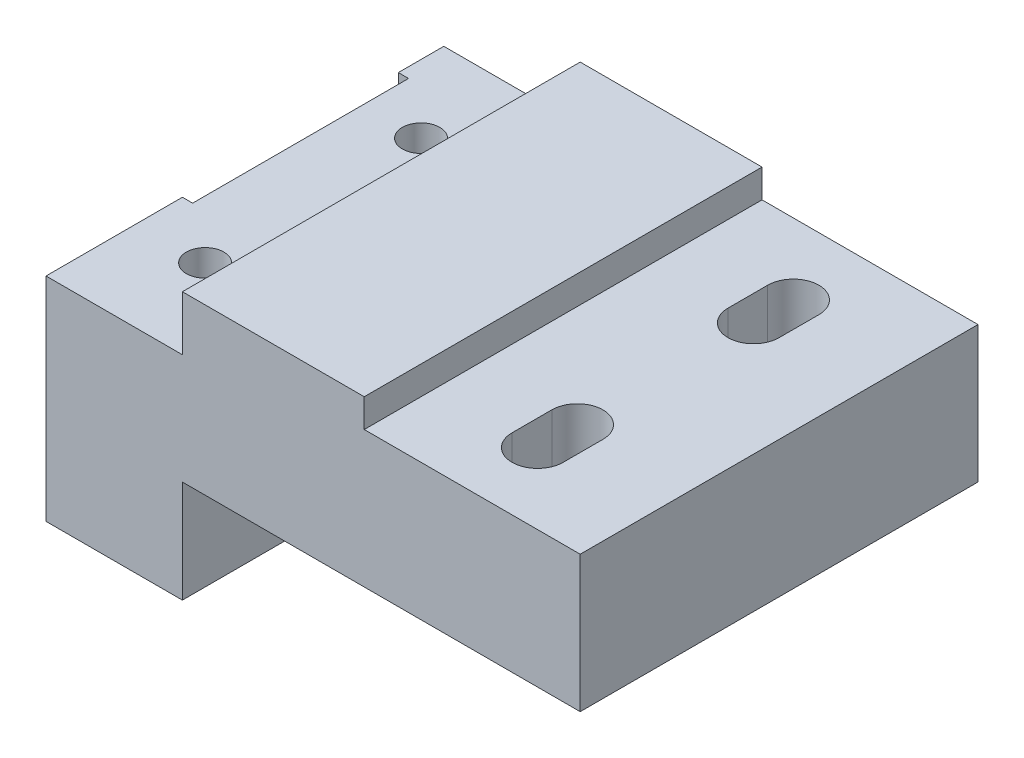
ISO-10303-21;
HEADER;
FILE_DESCRIPTION(('STEP AP214'),'2;1');
FILE_NAME('part.step','',(''),(''),'','','');
FILE_SCHEMA(('AUTOMOTIVE_DESIGN { 1 0 10303 214 1 1 1 1 }'));
ENDSEC;
DATA;
#1=APPLICATION_CONTEXT('core data for automotive mechanical design processes');
#2=APPLICATION_PROTOCOL_DEFINITION('international standard','automotive_design',2000,#1);
#3=PRODUCT_CONTEXT('',#1,'mechanical');
#4=PRODUCT('Part','Part','',(#3));
#5=PRODUCT_RELATED_PRODUCT_CATEGORY('part','',(#4));
#6=PRODUCT_DEFINITION_FORMATION('','',#4);
#7=PRODUCT_DEFINITION_CONTEXT('part definition',#1,'design');
#8=PRODUCT_DEFINITION('design','',#6,#7);
#9=PRODUCT_DEFINITION_SHAPE('','',#8);
#10=(LENGTH_UNIT() NAMED_UNIT(*) SI_UNIT(.MILLI.,.METRE.));
#11=(NAMED_UNIT(*) PLANE_ANGLE_UNIT() SI_UNIT($,.RADIAN.));
#12=(NAMED_UNIT(*) SI_UNIT($,.STERADIAN.) SOLID_ANGLE_UNIT());
#13=UNCERTAINTY_MEASURE_WITH_UNIT(LENGTH_MEASURE(1.E-05),#10,'distance_accuracy_value','');
#14=(GEOMETRIC_REPRESENTATION_CONTEXT(3) GLOBAL_UNCERTAINTY_ASSIGNED_CONTEXT((#13)) GLOBAL_UNIT_ASSIGNED_CONTEXT((#10,
#11,#12)) REPRESENTATION_CONTEXT('',''));
#15=CARTESIAN_POINT('',(0.,0.,0.));
#16=DIRECTION('',(0.,0.,1.));
#17=DIRECTION('',(1.,0.,0.));
#18=AXIS2_PLACEMENT_3D('',#15,#16,#17);
#19=CARTESIAN_POINT('',(-205.999999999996,220.185793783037,35.));
#20=DIRECTION('',(1.,0.,0.));
#21=DIRECTION('',(0.,1.,0.));
#22=AXIS2_PLACEMENT_3D('',#19,#20,#21);
#23=PLANE('',#22);
#24=DIRECTION('',(0.,-1.,0.));
#25=VECTOR('',#24,1.);
#26=CARTESIAN_POINT('',(-206.,220.185793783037,3.99999999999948));
#27=LINE('',#26,#25);
#28=CARTESIAN_POINT('',(-206.,211.185793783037,3.99999999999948));
#29=VERTEX_POINT('',#28);
#30=CARTESIAN_POINT('',(-206.,196.685793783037,3.99999999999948));
#31=VERTEX_POINT('',#30);
#32=EDGE_CURVE('E415',#29,#31,#27,.T.);
#33=ORIENTED_EDGE('',*,*,#32,.F.);
#34=DIRECTION('',(0.,0.,-1.));
#35=VECTOR('',#34,1.);
#36=CARTESIAN_POINT('',(-206.,211.185793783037,10.));
#37=LINE('',#36,#35);
#38=CARTESIAN_POINT('',(-206.,211.185793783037,0.));
#39=VERTEX_POINT('',#38);
#40=EDGE_CURVE('E390',#29,#39,#37,.T.);
#41=ORIENTED_EDGE('',*,*,#40,.T.);
#42=DIRECTION('',(0.,-1.,0.));
#43=VECTOR('',#42,1.);
#44=CARTESIAN_POINT('',(-205.999999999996,220.185793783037,0.));
#45=LINE('',#44,#43);
#46=CARTESIAN_POINT('',(-206.,196.685793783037,0.));
#47=VERTEX_POINT('',#46);
#48=EDGE_CURVE('E448',#39,#47,#45,.T.);
#49=ORIENTED_EDGE('',*,*,#48,.T.);
#50=DIRECTION('',(0.,0.,-1.));
#51=VECTOR('',#50,1.);
#52=CARTESIAN_POINT('',(-206.,196.685793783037,35.));
#53=LINE('',#52,#51);
#54=EDGE_CURVE('E464',#31,#47,#53,.T.);
#55=ORIENTED_EDGE('',*,*,#54,.F.);
#56=EDGE_LOOP('',(#33,#41,#49,#55));
#57=FACE_BOUND('',#56,.T.);
#58=ADVANCED_FACE('F16',(#57),#23,.F.);
#59=CARTESIAN_POINT('',(-205.099999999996,220.185793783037,3.99999999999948));
#60=DIRECTION('',(0.,0.,-1.));
#61=DIRECTION('',(-1.,0.,0.));
#62=AXIS2_PLACEMENT_3D('',#59,#60,#61);
#63=PLANE('',#62);
#64=DIRECTION('',(0.,-1.,0.));
#65=VECTOR('',#64,1.);
#66=CARTESIAN_POINT('',(-205.099999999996,220.185793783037,3.99999999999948));
#67=LINE('',#66,#65);
#68=CARTESIAN_POINT('',(-205.1,211.185793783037,3.99999999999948));
#69=VERTEX_POINT('',#68);
#70=CARTESIAN_POINT('',(-205.099999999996,196.685793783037,3.99999999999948));
#71=VERTEX_POINT('',#70);
#72=EDGE_CURVE('E412',#69,#71,#67,.T.);
#73=ORIENTED_EDGE('',*,*,#72,.F.);
#74=DIRECTION('',(-1.,0.,0.));
#75=VECTOR('',#74,1.);
#76=CARTESIAN_POINT('',(-205.099999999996,211.185793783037,3.99999999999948));
#77=LINE('',#76,#75);
#78=EDGE_CURVE('E480',#69,#29,#77,.T.);
#79=ORIENTED_EDGE('',*,*,#78,.T.);
#80=ORIENTED_EDGE('',*,*,#32,.T.);
#81=DIRECTION('',(1.,0.,0.));
#82=VECTOR('',#81,1.);
#83=CARTESIAN_POINT('',(-205.099999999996,196.685793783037,3.99999999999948));
#84=LINE('',#83,#82);
#85=EDGE_CURVE('E405',#31,#71,#84,.T.);
#86=ORIENTED_EDGE('',*,*,#85,.T.);
#87=EDGE_LOOP('',(#73,#79,#80,#86));
#88=FACE_BOUND('',#87,.T.);
#89=ADVANCED_FACE('F544',(#88),#63,.F.);
#90=CARTESIAN_POINT('',(-205.999999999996,215.385793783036,3.99999999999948));
#91=VERTEX_POINT('',#90);
#92=CARTESIAN_POINT('',(-206.,213.185793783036,3.99999999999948));
#93=VERTEX_POINT('',#92);
#94=EDGE_CURVE('E413',#91,#93,#27,.T.);
#95=ORIENTED_EDGE('',*,*,#94,.F.);
#96=DIRECTION('',(0.,0.,1.));
#97=VECTOR('',#96,1.);
#98=CARTESIAN_POINT('',(-205.999999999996,215.385793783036,0.));
#99=LINE('',#98,#97);
#100=CARTESIAN_POINT('',(-205.999999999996,215.385793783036,0.));
#101=VERTEX_POINT('',#100);
#102=EDGE_CURVE('E374',#101,#91,#99,.T.);
#103=ORIENTED_EDGE('',*,*,#102,.F.);
#104=CARTESIAN_POINT('',(-206.,213.185793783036,0.));
#105=VERTEX_POINT('',#104);
#106=EDGE_CURVE('E449',#101,#105,#45,.T.);
#107=ORIENTED_EDGE('',*,*,#106,.T.);
#108=DIRECTION('',(0.,0.,-1.));
#109=VECTOR('',#108,1.);
#110=CARTESIAN_POINT('',(-206.,213.185793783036,10.));
#111=LINE('',#110,#109);
#112=EDGE_CURVE('E389',#93,#105,#111,.T.);
#113=ORIENTED_EDGE('',*,*,#112,.F.);
#114=EDGE_LOOP('',(#95,#103,#107,#113));
#115=FACE_BOUND('',#114,.T.);
#116=ADVANCED_FACE('F547',(#115),#23,.F.);
#117=CARTESIAN_POINT('',(-159.,217.685793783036,35.));
#118=DIRECTION('',(-1.,0.,0.));
#119=DIRECTION('',(0.,0.,1.));
#120=AXIS2_PLACEMENT_3D('',#117,#118,#119);
#121=PLANE('',#120);
#122=DIRECTION('',(0.,1.,0.));
#123=VECTOR('',#122,1.);
#124=CARTESIAN_POINT('',(-159.,217.685793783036,0.));
#125=LINE('',#124,#123);
#126=CARTESIAN_POINT('',(-159.,205.685793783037,0.));
#127=VERTEX_POINT('',#126);
#128=CARTESIAN_POINT('',(-159.,217.685793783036,0.));
#129=VERTEX_POINT('',#128);
#130=EDGE_CURVE('E411',#127,#129,#125,.T.);
#131=ORIENTED_EDGE('',*,*,#130,.T.);
#132=DIRECTION('',(0.,0.,-1.));
#133=VECTOR('',#132,1.);
#134=CARTESIAN_POINT('',(-159.,217.685793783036,35.));
#135=LINE('',#134,#133);
#136=CARTESIAN_POINT('',(-159.,217.685793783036,35.));
#137=VERTEX_POINT('',#136);
#138=EDGE_CURVE('E474',#137,#129,#135,.T.);
#139=ORIENTED_EDGE('',*,*,#138,.F.);
#140=DIRECTION('',(0.,1.,0.));
#141=VECTOR('',#140,1.);
#142=CARTESIAN_POINT('',(-159.,217.685793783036,35.));
#143=LINE('',#142,#141);
#144=CARTESIAN_POINT('',(-159.,205.685793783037,35.));
#145=VERTEX_POINT('',#144);
#146=EDGE_CURVE('E419',#145,#137,#143,.T.);
#147=ORIENTED_EDGE('',*,*,#146,.F.);
#148=DIRECTION('',(0.,0.,-1.));
#149=VECTOR('',#148,1.);
#150=CARTESIAN_POINT('',(-159.,205.685793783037,35.));
#151=LINE('',#150,#149);
#152=EDGE_CURVE('E438',#145,#127,#151,.T.);
#153=ORIENTED_EDGE('',*,*,#152,.T.);
#154=EDGE_LOOP('',(#131,#139,#147,#153));
#155=FACE_BOUND('',#154,.T.);
#156=ADVANCED_FACE('F18',(#155),#121,.F.);
#157=CARTESIAN_POINT('',(-159.,217.685793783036,35.));
#158=DIRECTION('',(0.,-1.,0.));
#159=DIRECTION('',(0.,0.,-1.));
#160=AXIS2_PLACEMENT_3D('',#157,#158,#159);
#161=PLANE('',#160);
#162=CARTESIAN_POINT('',(-169.,217.685793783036,28.75));
#163=DIRECTION('',(0.,-1.,0.));
#164=DIRECTION('',(0.,0.,-1.));
#165=AXIS2_PLACEMENT_3D('',#162,#163,#164);
#166=CIRCLE('',#165,2.25);
#167=CARTESIAN_POINT('',(-166.75,217.685793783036,28.75));
#168=VERTEX_POINT('',#167);
#169=CARTESIAN_POINT('',(-171.25,217.685793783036,28.75));
#170=VERTEX_POINT('',#169);
#171=EDGE_CURVE('E24',#168,#170,#166,.T.);
#172=ORIENTED_EDGE('',*,*,#171,.T.);
#173=DIRECTION('',(0.,0.,-1.));
#174=VECTOR('',#173,1.);
#175=CARTESIAN_POINT('',(-171.25,217.685793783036,35.));
#176=LINE('',#175,#174);
#177=CARTESIAN_POINT('',(-171.25,217.685793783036,25.25));
#178=VERTEX_POINT('',#177);
#179=EDGE_CURVE('E11',#170,#178,#176,.T.);
#180=ORIENTED_EDGE('',*,*,#179,.T.);
#181=CARTESIAN_POINT('',(-169.,217.685793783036,25.25));
#182=DIRECTION('',(0.,-1.,0.));
#183=DIRECTION('',(0.,0.,-1.));
#184=AXIS2_PLACEMENT_3D('',#181,#182,#183);
#185=CIRCLE('',#184,2.25);
#186=CARTESIAN_POINT('',(-166.75,217.685793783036,25.25));
#187=VERTEX_POINT('',#186);
#188=EDGE_CURVE('E501',#178,#187,#185,.T.);
#189=ORIENTED_EDGE('',*,*,#188,.T.);
#190=DIRECTION('',(0.,0.,1.));
#191=VECTOR('',#190,1.);
#192=CARTESIAN_POINT('',(-166.75,217.685793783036,35.));
#193=LINE('',#192,#191);
#194=EDGE_CURVE('E498',#187,#168,#193,.T.);
#195=ORIENTED_EDGE('',*,*,#194,.T.);
#196=EDGE_LOOP('',(#172,#180,#189,#195));
#197=FACE_BOUND('',#196,.T.);
#198=CARTESIAN_POINT('',(-169.,217.685793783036,9.75));
#199=DIRECTION('',(0.,-1.,0.));
#200=DIRECTION('',(0.,0.,-1.));
#201=AXIS2_PLACEMENT_3D('',#198,#199,#200);
#202=CIRCLE('',#201,2.25);
#203=CARTESIAN_POINT('',(-166.75,217.685793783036,9.75));
#204=VERTEX_POINT('',#203);
#205=CARTESIAN_POINT('',(-171.25,217.685793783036,9.75));
#206=VERTEX_POINT('',#205);
#207=EDGE_CURVE('E492',#204,#206,#202,.T.);
#208=ORIENTED_EDGE('',*,*,#207,.T.);
#209=DIRECTION('',(0.,0.,-1.));
#210=VECTOR('',#209,1.);
#211=CARTESIAN_POINT('',(-171.25,217.685793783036,35.));
#212=LINE('',#211,#210);
#213=CARTESIAN_POINT('',(-171.25,217.685793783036,6.25));
#214=VERTEX_POINT('',#213);
#215=EDGE_CURVE('E495',#206,#214,#212,.T.);
#216=ORIENTED_EDGE('',*,*,#215,.T.);
#217=CARTESIAN_POINT('',(-169.,217.685793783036,6.25));
#218=DIRECTION('',(0.,-1.,0.));
#219=DIRECTION('',(0.,0.,-1.));
#220=AXIS2_PLACEMENT_3D('',#217,#218,#219);
#221=CIRCLE('',#220,2.25);
#222=CARTESIAN_POINT('',(-166.75,217.685793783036,6.25));
#223=VERTEX_POINT('',#222);
#224=EDGE_CURVE('E489',#214,#223,#221,.T.);
#225=ORIENTED_EDGE('',*,*,#224,.T.);
#226=DIRECTION('',(0.,0.,1.));
#227=VECTOR('',#226,1.);
#228=CARTESIAN_POINT('',(-166.75,217.685793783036,35.));
#229=LINE('',#228,#227);
#230=EDGE_CURVE('E486',#223,#204,#229,.T.);
#231=ORIENTED_EDGE('',*,*,#230,.T.);
#232=EDGE_LOOP('',(#208,#216,#225,#231));
#233=FACE_BOUND('',#232,.T.);
#234=DIRECTION('',(-1.,0.,0.));
#235=VECTOR('',#234,1.);
#236=CARTESIAN_POINT('',(-159.,217.685793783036,0.));
#237=LINE('',#236,#235);
#238=CARTESIAN_POINT('',(-177.999999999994,217.685793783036,0.));
#239=VERTEX_POINT('',#238);
#240=EDGE_CURVE('E441',#129,#239,#237,.T.);
#241=ORIENTED_EDGE('',*,*,#240,.T.);
#242=DIRECTION('',(0.,0.,-1.));
#243=VECTOR('',#242,1.);
#244=CARTESIAN_POINT('',(-177.999999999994,217.685793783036,35.));
#245=LINE('',#244,#243);
#246=CARTESIAN_POINT('',(-177.999999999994,217.685793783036,35.));
#247=VERTEX_POINT('',#246);
#248=EDGE_CURVE('E471',#247,#239,#245,.T.);
#249=ORIENTED_EDGE('',*,*,#248,.F.);
#250=DIRECTION('',(-1.,0.,0.));
#251=VECTOR('',#250,1.);
#252=CARTESIAN_POINT('',(-159.,217.685793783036,35.));
#253=LINE('',#252,#251);
#254=EDGE_CURVE('E422',#137,#247,#253,.T.);
#255=ORIENTED_EDGE('',*,*,#254,.F.);
#256=ORIENTED_EDGE('',*,*,#138,.T.);
#257=EDGE_LOOP('',(#241,#249,#255,#256));
#258=FACE_BOUND('',#257,.T.);
#259=ADVANCED_FACE('F505',(#197,#233,#258),#161,.F.);
#260=CARTESIAN_POINT('',(-177.999999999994,217.685793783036,35.));
#261=DIRECTION('',(-1.,0.,0.));
#262=DIRECTION('',(0.,0.,1.));
#263=AXIS2_PLACEMENT_3D('',#260,#261,#262);
#264=PLANE('',#263);
#265=DIRECTION('',(0.,1.,0.));
#266=VECTOR('',#265,1.);
#267=CARTESIAN_POINT('',(-177.999999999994,217.685793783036,0.));
#268=LINE('',#267,#266);
#269=CARTESIAN_POINT('',(-177.999999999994,220.185793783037,0.));
#270=VERTEX_POINT('',#269);
#271=EDGE_CURVE('E443',#239,#270,#268,.T.);
#272=ORIENTED_EDGE('',*,*,#271,.T.);
#273=DIRECTION('',(0.,0.,-1.));
#274=VECTOR('',#273,1.);
#275=CARTESIAN_POINT('',(-177.999999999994,220.185793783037,35.));
#276=LINE('',#275,#274);
#277=CARTESIAN_POINT('',(-177.999999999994,220.185793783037,35.));
#278=VERTEX_POINT('',#277);
#279=EDGE_CURVE('E468',#278,#270,#276,.T.);
#280=ORIENTED_EDGE('',*,*,#279,.F.);
#281=DIRECTION('',(0.,1.,0.));
#282=VECTOR('',#281,1.);
#283=CARTESIAN_POINT('',(-177.999999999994,217.685793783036,35.));
#284=LINE('',#283,#282);
#285=EDGE_CURVE('E425',#247,#278,#284,.T.);
#286=ORIENTED_EDGE('',*,*,#285,.F.);
#287=ORIENTED_EDGE('',*,*,#248,.T.);
#288=EDGE_LOOP('',(#272,#280,#286,#287));
#289=FACE_BOUND('',#288,.T.);
#290=ADVANCED_FACE('F572',(#289),#264,.F.);
#291=CARTESIAN_POINT('',(-205.999999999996,220.185793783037,35.));
#292=DIRECTION('',(0.,-1.,0.));
#293=DIRECTION('',(0.,0.,-1.));
#294=AXIS2_PLACEMENT_3D('',#291,#292,#293);
#295=PLANE('',#294);
#296=DIRECTION('',(-1.,0.,0.));
#297=VECTOR('',#296,1.);
#298=CARTESIAN_POINT('',(-205.999999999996,220.185793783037,0.));
#299=LINE('',#298,#297);
#300=CARTESIAN_POINT('',(-193.999999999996,220.185793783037,0.));
#301=VERTEX_POINT('',#300);
#302=EDGE_CURVE('E445',#270,#301,#299,.T.);
#303=ORIENTED_EDGE('',*,*,#302,.T.);
#304=DIRECTION('',(0.,0.,1.));
#305=VECTOR('',#304,1.);
#306=CARTESIAN_POINT('',(-193.999999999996,220.185793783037,0.));
#307=LINE('',#306,#305);
#308=CARTESIAN_POINT('',(-193.999999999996,220.185793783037,35.));
#309=VERTEX_POINT('',#308);
#310=EDGE_CURVE('E368',#301,#309,#307,.T.);
#311=ORIENTED_EDGE('',*,*,#310,.T.);
#312=DIRECTION('',(-1.,0.,0.));
#313=VECTOR('',#312,1.);
#314=CARTESIAN_POINT('',(-205.999999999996,220.185793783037,35.));
#315=LINE('',#314,#313);
#316=EDGE_CURVE('E427',#278,#309,#315,.T.);
#317=ORIENTED_EDGE('',*,*,#316,.F.);
#318=ORIENTED_EDGE('',*,*,#279,.T.);
#319=EDGE_LOOP('',(#303,#311,#317,#318));
#320=FACE_BOUND('',#319,.T.);
#321=ADVANCED_FACE('F563',(#320),#295,.F.);
#322=DIRECTION('',(0.,-1.,0.));
#323=VECTOR('',#322,1.);
#324=CARTESIAN_POINT('',(-205.999999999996,220.185793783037,35.));
#325=LINE('',#324,#323);
#326=CARTESIAN_POINT('',(-205.999999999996,215.385793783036,35.));
#327=VERTEX_POINT('',#326);
#328=CARTESIAN_POINT('',(-206.,196.685793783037,35.));
#329=VERTEX_POINT('',#328);
#330=EDGE_CURVE('E430',#327,#329,#325,.T.);
#331=ORIENTED_EDGE('',*,*,#330,.F.);
#332=CARTESIAN_POINT('',(-205.999999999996,215.385793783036,22.9999999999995));
#333=VERTEX_POINT('',#332);
#334=EDGE_CURVE('E364',#333,#327,#99,.T.);
#335=ORIENTED_EDGE('',*,*,#334,.F.);
#336=DIRECTION('',(0.,-1.,0.));
#337=VECTOR('',#336,1.);
#338=CARTESIAN_POINT('',(-206.,220.185793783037,22.9999999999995));
#339=LINE('',#338,#337);
#340=CARTESIAN_POINT('',(-206.,196.685793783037,22.9999999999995));
#341=VERTEX_POINT('',#340);
#342=EDGE_CURVE('E416',#333,#341,#339,.T.);
#343=ORIENTED_EDGE('',*,*,#342,.T.);
#344=EDGE_CURVE('E465',#329,#341,#53,.T.);
#345=ORIENTED_EDGE('',*,*,#344,.F.);
#346=EDGE_LOOP('',(#331,#335,#343,#345));
#347=FACE_BOUND('',#346,.T.);
#348=ADVANCED_FACE('F548',(#347),#23,.F.);
#349=CARTESIAN_POINT('',(-194.,196.685793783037,35.));
#350=DIRECTION('',(0.,1.,0.));
#351=DIRECTION('',(0.,0.,1.));
#352=AXIS2_PLACEMENT_3D('',#349,#350,#351);
#353=PLANE('',#352);
#354=DIRECTION('',(0.,0.,1.));
#355=VECTOR('',#354,1.);
#356=CARTESIAN_POINT('',(-205.099999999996,196.685793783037,3.99999999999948));
#357=LINE('',#356,#355);
#358=CARTESIAN_POINT('',(-205.099999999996,196.685793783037,22.9999999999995));
#359=VERTEX_POINT('',#358);
#360=EDGE_CURVE('E393',#71,#359,#357,.T.);
#361=ORIENTED_EDGE('',*,*,#360,.F.);
#362=ORIENTED_EDGE('',*,*,#85,.F.);
#363=ORIENTED_EDGE('',*,*,#54,.T.);
#364=DIRECTION('',(1.,0.,0.));
#365=VECTOR('',#364,1.);
#366=CARTESIAN_POINT('',(-194.,196.685793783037,0.));
#367=LINE('',#366,#365);
#368=CARTESIAN_POINT('',(-194.,196.685793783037,0.));
#369=VERTEX_POINT('',#368);
#370=EDGE_CURVE('E451',#47,#369,#367,.T.);
#371=ORIENTED_EDGE('',*,*,#370,.T.);
#372=DIRECTION('',(0.,0.,-1.));
#373=VECTOR('',#372,1.);
#374=CARTESIAN_POINT('',(-194.,196.685793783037,35.));
#375=LINE('',#374,#373);
#376=CARTESIAN_POINT('',(-194.,196.685793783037,35.));
#377=VERTEX_POINT('',#376);
#378=EDGE_CURVE('E461',#377,#369,#375,.T.);
#379=ORIENTED_EDGE('',*,*,#378,.F.);
#380=DIRECTION('',(1.,0.,0.));
#381=VECTOR('',#380,1.);
#382=CARTESIAN_POINT('',(-194.,196.685793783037,35.));
#383=LINE('',#382,#381);
#384=EDGE_CURVE('E432',#329,#377,#383,.T.);
#385=ORIENTED_EDGE('',*,*,#384,.F.);
#386=ORIENTED_EDGE('',*,*,#344,.T.);
#387=DIRECTION('',(-1.,0.,0.));
#388=VECTOR('',#387,1.);
#389=CARTESIAN_POINT('',(-205.099999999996,196.685793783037,22.9999999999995));
#390=LINE('',#389,#388);
#391=EDGE_CURVE('E402',#359,#341,#390,.T.);
#392=ORIENTED_EDGE('',*,*,#391,.F.);
#393=EDGE_LOOP('',(#361,#362,#363,#371,#379,#385,#386,#392));
#394=FACE_BOUND('',#393,.T.);
#395=ADVANCED_FACE('F562',(#394),#353,.F.);
#396=CARTESIAN_POINT('',(-193.999999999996,205.685793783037,35.));
#397=DIRECTION('',(-1.,2.22044604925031E-13,0.));
#398=DIRECTION('',(-2.22044604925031E-13,-1.,0.));
#399=AXIS2_PLACEMENT_3D('',#396,#397,#398);
#400=PLANE('',#399);
#401=DIRECTION('',(2.22044604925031E-13,1.,0.));
#402=VECTOR('',#401,1.);
#403=CARTESIAN_POINT('',(-193.999999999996,205.685793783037,0.));
#404=LINE('',#403,#402);
#405=CARTESIAN_POINT('',(-193.999999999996,205.685793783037,0.));
#406=VERTEX_POINT('',#405);
#407=EDGE_CURVE('E453',#369,#406,#404,.T.);
#408=ORIENTED_EDGE('',*,*,#407,.T.);
#409=DIRECTION('',(0.,0.,-1.));
#410=VECTOR('',#409,1.);
#411=CARTESIAN_POINT('',(-193.999999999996,205.685793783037,35.));
#412=LINE('',#411,#410);
#413=CARTESIAN_POINT('',(-193.999999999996,205.685793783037,35.));
#414=VERTEX_POINT('',#413);
#415=EDGE_CURVE('E458',#414,#406,#412,.T.);
#416=ORIENTED_EDGE('',*,*,#415,.F.);
#417=DIRECTION('',(2.22044604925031E-13,1.,0.));
#418=VECTOR('',#417,1.);
#419=CARTESIAN_POINT('',(-193.999999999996,205.685793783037,35.));
#420=LINE('',#419,#418);
#421=EDGE_CURVE('E434',#377,#414,#420,.T.);
#422=ORIENTED_EDGE('',*,*,#421,.F.);
#423=ORIENTED_EDGE('',*,*,#378,.T.);
#424=EDGE_LOOP('',(#408,#416,#422,#423));
#425=FACE_BOUND('',#424,.T.);
#426=ADVANCED_FACE('F570',(#425),#400,.F.);
#427=CARTESIAN_POINT('',(-159.,205.685793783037,35.));
#428=DIRECTION('',(0.,1.,0.));
#429=DIRECTION('',(0.,0.,1.));
#430=AXIS2_PLACEMENT_3D('',#427,#428,#429);
#431=PLANE('',#430);
#432=CARTESIAN_POINT('',(-169.,205.685793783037,25.25));
#433=DIRECTION('',(0.,-1.,0.));
#434=DIRECTION('',(0.,0.,-1.));
#435=AXIS2_PLACEMENT_3D('',#432,#433,#434);
#436=CIRCLE('',#435,4.);
#437=CARTESIAN_POINT('',(-173.,205.685793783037,25.25));
#438=VERTEX_POINT('',#437);
#439=CARTESIAN_POINT('',(-165.,205.685793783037,25.25));
#440=VERTEX_POINT('',#439);
#441=EDGE_CURVE('E254',#438,#440,#436,.T.);
#442=ORIENTED_EDGE('',*,*,#441,.F.);
#443=DIRECTION('',(0.,0.,1.));
#444=VECTOR('',#443,1.);
#445=CARTESIAN_POINT('',(-173.,205.685793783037,25.25));
#446=LINE('',#445,#444);
#447=CARTESIAN_POINT('',(-173.,205.685793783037,28.75));
#448=VERTEX_POINT('',#447);
#449=EDGE_CURVE('E272',#438,#448,#446,.T.);
#450=ORIENTED_EDGE('',*,*,#449,.T.);
#451=CARTESIAN_POINT('',(-169.,205.685793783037,28.75));
#452=DIRECTION('',(0.,-1.,0.));
#453=DIRECTION('',(0.,0.,-1.));
#454=AXIS2_PLACEMENT_3D('',#451,#452,#453);
#455=CIRCLE('',#454,4.);
#456=CARTESIAN_POINT('',(-165.,205.685793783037,28.75));
#457=VERTEX_POINT('',#456);
#458=EDGE_CURVE('E284',#457,#448,#455,.T.);
#459=ORIENTED_EDGE('',*,*,#458,.F.);
#460=DIRECTION('',(0.,0.,1.));
#461=VECTOR('',#460,1.);
#462=CARTESIAN_POINT('',(-165.,205.685793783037,25.25));
#463=LINE('',#462,#461);
#464=EDGE_CURVE('E261',#440,#457,#463,.T.);
#465=ORIENTED_EDGE('',*,*,#464,.F.);
#466=EDGE_LOOP('',(#442,#450,#459,#465));
#467=FACE_BOUND('',#466,.T.);
#468=CARTESIAN_POINT('',(-169.,205.685793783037,6.25));
#469=DIRECTION('',(0.,-1.,0.));
#470=DIRECTION('',(0.,0.,-1.));
#471=AXIS2_PLACEMENT_3D('',#468,#469,#470);
#472=CIRCLE('',#471,4.);
#473=CARTESIAN_POINT('',(-173.,205.685793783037,6.25));
#474=VERTEX_POINT('',#473);
#475=CARTESIAN_POINT('',(-165.,205.685793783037,6.25));
#476=VERTEX_POINT('',#475);
#477=EDGE_CURVE('E317',#474,#476,#472,.T.);
#478=ORIENTED_EDGE('',*,*,#477,.F.);
#479=DIRECTION('',(0.,0.,1.));
#480=VECTOR('',#479,1.);
#481=CARTESIAN_POINT('',(-173.,205.685793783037,6.25));
#482=LINE('',#481,#480);
#483=CARTESIAN_POINT('',(-173.,205.685793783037,9.75));
#484=VERTEX_POINT('',#483);
#485=EDGE_CURVE('E305',#474,#484,#482,.T.);
#486=ORIENTED_EDGE('',*,*,#485,.T.);
#487=CARTESIAN_POINT('',(-169.,205.685793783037,9.75));
#488=DIRECTION('',(0.,-1.,0.));
#489=DIRECTION('',(0.,0.,-1.));
#490=AXIS2_PLACEMENT_3D('',#487,#488,#489);
#491=CIRCLE('',#490,4.);
#492=CARTESIAN_POINT('',(-165.,205.685793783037,9.75));
#493=VERTEX_POINT('',#492);
#494=EDGE_CURVE('E333',#493,#484,#491,.T.);
#495=ORIENTED_EDGE('',*,*,#494,.F.);
#496=DIRECTION('',(0.,0.,1.));
#497=VECTOR('',#496,1.);
#498=CARTESIAN_POINT('',(-165.,205.685793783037,6.25));
#499=LINE('',#498,#497);
#500=EDGE_CURVE('E294',#476,#493,#499,.T.);
#501=ORIENTED_EDGE('',*,*,#500,.F.);
#502=EDGE_LOOP('',(#478,#486,#495,#501));
#503=FACE_BOUND('',#502,.T.);
#504=DIRECTION('',(1.,0.,0.));
#505=VECTOR('',#504,1.);
#506=CARTESIAN_POINT('',(-159.,205.685793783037,0.));
#507=LINE('',#506,#505);
#508=EDGE_CURVE('E423',#406,#127,#507,.T.);
#509=ORIENTED_EDGE('',*,*,#508,.T.);
#510=ORIENTED_EDGE('',*,*,#152,.F.);
#511=DIRECTION('',(1.,0.,0.));
#512=VECTOR('',#511,1.);
#513=CARTESIAN_POINT('',(-159.,205.685793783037,35.));
#514=LINE('',#513,#512);
#515=EDGE_CURVE('E436',#414,#145,#514,.T.);
#516=ORIENTED_EDGE('',*,*,#515,.F.);
#517=ORIENTED_EDGE('',*,*,#415,.T.);
#518=EDGE_LOOP('',(#509,#510,#516,#517));
#519=FACE_BOUND('',#518,.T.);
#520=ADVANCED_FACE('F524',(#467,#503,#519),#431,.F.);
#521=CARTESIAN_POINT('',(0.,0.,35.));
#522=DIRECTION('',(0.,0.,-1.));
#523=DIRECTION('',(-1.,0.,0.));
#524=AXIS2_PLACEMENT_3D('',#521,#522,#523);
#525=PLANE('',#524);
#526=ORIENTED_EDGE('',*,*,#316,.T.);
#527=DIRECTION('',(0.,1.,0.));
#528=VECTOR('',#527,1.);
#529=CARTESIAN_POINT('',(-193.999999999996,220.185793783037,35.));
#530=LINE('',#529,#528);
#531=CARTESIAN_POINT('',(-193.999999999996,215.385793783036,35.));
#532=VERTEX_POINT('',#531);
#533=EDGE_CURVE('E361',#532,#309,#530,.T.);
#534=ORIENTED_EDGE('',*,*,#533,.F.);
#535=DIRECTION('',(1.,0.,0.));
#536=VECTOR('',#535,1.);
#537=CARTESIAN_POINT('',(-205.999999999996,215.385793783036,35.));
#538=LINE('',#537,#536);
#539=EDGE_CURVE('E356',#327,#532,#538,.T.);
#540=ORIENTED_EDGE('',*,*,#539,.F.);
#541=ORIENTED_EDGE('',*,*,#330,.T.);
#542=ORIENTED_EDGE('',*,*,#384,.T.);
#543=ORIENTED_EDGE('',*,*,#421,.T.);
#544=ORIENTED_EDGE('',*,*,#515,.T.);
#545=ORIENTED_EDGE('',*,*,#146,.T.);
#546=ORIENTED_EDGE('',*,*,#254,.T.);
#547=ORIENTED_EDGE('',*,*,#285,.T.);
#548=EDGE_LOOP('',(#526,#534,#540,#541,#542,#543,#544,#545,#546,#547));
#549=FACE_BOUND('',#548,.T.);
#550=ADVANCED_FACE('F581',(#549),#525,.F.);
#551=CARTESIAN_POINT('',(0.,0.,0.));
#552=DIRECTION('',(0.,0.,-1.));
#553=DIRECTION('',(-1.,0.,0.));
#554=AXIS2_PLACEMENT_3D('',#551,#552,#553);
#555=PLANE('',#554);
#556=DIRECTION('',(0.,1.,0.));
#557=VECTOR('',#556,1.);
#558=CARTESIAN_POINT('',(-193.999999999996,220.185793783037,0.));
#559=LINE('',#558,#557);
#560=CARTESIAN_POINT('',(-193.999999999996,215.385793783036,0.));
#561=VERTEX_POINT('',#560);
#562=EDGE_CURVE('E360',#561,#301,#559,.T.);
#563=ORIENTED_EDGE('',*,*,#562,.T.);
#564=ORIENTED_EDGE('',*,*,#302,.F.);
#565=ORIENTED_EDGE('',*,*,#271,.F.);
#566=ORIENTED_EDGE('',*,*,#240,.F.);
#567=ORIENTED_EDGE('',*,*,#130,.F.);
#568=ORIENTED_EDGE('',*,*,#508,.F.);
#569=ORIENTED_EDGE('',*,*,#407,.F.);
#570=ORIENTED_EDGE('',*,*,#370,.F.);
#571=ORIENTED_EDGE('',*,*,#48,.F.);
#572=DIRECTION('',(-1.,0.,0.));
#573=VECTOR('',#572,1.);
#574=CARTESIAN_POINT('',(-206.,211.185793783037,0.));
#575=LINE('',#574,#573);
#576=CARTESIAN_POINT('',(-205.1,211.185793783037,0.));
#577=VERTEX_POINT('',#576);
#578=EDGE_CURVE('E387',#577,#39,#575,.T.);
#579=ORIENTED_EDGE('',*,*,#578,.F.);
#580=DIRECTION('',(0.,-1.,0.));
#581=VECTOR('',#580,1.);
#582=CARTESIAN_POINT('',(-205.1,211.185793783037,0.));
#583=LINE('',#582,#581);
#584=CARTESIAN_POINT('',(-205.1,213.185793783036,0.));
#585=VERTEX_POINT('',#584);
#586=EDGE_CURVE('E384',#585,#577,#583,.T.);
#587=ORIENTED_EDGE('',*,*,#586,.F.);
#588=DIRECTION('',(1.,0.,0.));
#589=VECTOR('',#588,1.);
#590=CARTESIAN_POINT('',(-206.,213.185793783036,0.));
#591=LINE('',#590,#589);
#592=EDGE_CURVE('E381',#105,#585,#591,.T.);
#593=ORIENTED_EDGE('',*,*,#592,.F.);
#594=ORIENTED_EDGE('',*,*,#106,.F.);
#595=DIRECTION('',(1.,0.,0.));
#596=VECTOR('',#595,1.);
#597=CARTESIAN_POINT('',(-205.999999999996,215.385793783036,0.));
#598=LINE('',#597,#596);
#599=EDGE_CURVE('E357',#101,#561,#598,.T.);
#600=ORIENTED_EDGE('',*,*,#599,.T.);
#601=EDGE_LOOP('',(#563,#564,#565,#566,#567,#568,#569,#570,#571,#579,#587,#593,#594,#600));
#602=FACE_BOUND('',#601,.T.);
#603=ADVANCED_FACE('F623',(#602),#555,.T.);
#604=CARTESIAN_POINT('',(-205.099999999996,220.185793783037,3.99999999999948));
#605=DIRECTION('',(1.,0.,0.));
#606=DIRECTION('',(0.,0.,-1.));
#607=AXIS2_PLACEMENT_3D('',#604,#605,#606);
#608=PLANE('',#607);
#609=DIRECTION('',(0.,-1.,0.));
#610=VECTOR('',#609,1.);
#611=CARTESIAN_POINT('',(-205.099999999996,220.185793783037,22.9999999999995));
#612=LINE('',#611,#610);
#613=CARTESIAN_POINT('',(-205.099999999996,215.385793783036,22.9999999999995));
#614=VERTEX_POINT('',#613);
#615=EDGE_CURVE('E408',#614,#359,#612,.T.);
#616=ORIENTED_EDGE('',*,*,#615,.F.);
#617=DIRECTION('',(0.,0.,-1.));
#618=VECTOR('',#617,1.);
#619=CARTESIAN_POINT('',(-205.099999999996,215.385793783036,3.99999999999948));
#620=LINE('',#619,#618);
#621=CARTESIAN_POINT('',(-205.099999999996,215.385793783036,3.99999999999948));
#622=VERTEX_POINT('',#621);
#623=EDGE_CURVE('E371',#614,#622,#620,.T.);
#624=ORIENTED_EDGE('',*,*,#623,.T.);
#625=CARTESIAN_POINT('',(-205.099999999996,213.185793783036,3.99999999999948));
#626=VERTEX_POINT('',#625);
#627=EDGE_CURVE('E409',#622,#626,#67,.T.);
#628=ORIENTED_EDGE('',*,*,#627,.T.);
#629=DIRECTION('',(0.,0.,-1.));
#630=VECTOR('',#629,1.);
#631=CARTESIAN_POINT('',(-205.1,213.185793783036,10.));
#632=LINE('',#631,#630);
#633=EDGE_CURVE('E396',#626,#585,#632,.T.);
#634=ORIENTED_EDGE('',*,*,#633,.T.);
#635=ORIENTED_EDGE('',*,*,#586,.T.);
#636=DIRECTION('',(0.,0.,-1.));
#637=VECTOR('',#636,1.);
#638=CARTESIAN_POINT('',(-205.1,211.185793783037,10.));
#639=LINE('',#638,#637);
#640=EDGE_CURVE('E394',#69,#577,#639,.T.);
#641=ORIENTED_EDGE('',*,*,#640,.F.);
#642=ORIENTED_EDGE('',*,*,#72,.T.);
#643=ORIENTED_EDGE('',*,*,#360,.T.);
#644=EDGE_LOOP('',(#616,#624,#628,#634,#635,#641,#642,#643));
#645=FACE_BOUND('',#644,.T.);
#646=ADVANCED_FACE('F591',(#645),#608,.F.);
#647=ORIENTED_EDGE('',*,*,#627,.F.);
#648=DIRECTION('',(-1.,0.,0.));
#649=VECTOR('',#648,1.);
#650=CARTESIAN_POINT('',(-205.099999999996,215.385793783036,3.99999999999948));
#651=LINE('',#650,#649);
#652=EDGE_CURVE('E378',#622,#91,#651,.T.);
#653=ORIENTED_EDGE('',*,*,#652,.T.);
#654=ORIENTED_EDGE('',*,*,#94,.T.);
#655=DIRECTION('',(1.,0.,0.));
#656=VECTOR('',#655,1.);
#657=CARTESIAN_POINT('',(-205.099999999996,213.185793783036,3.99999999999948));
#658=LINE('',#657,#656);
#659=EDGE_CURVE('E477',#93,#626,#658,.T.);
#660=ORIENTED_EDGE('',*,*,#659,.T.);
#661=EDGE_LOOP('',(#647,#653,#654,#660));
#662=FACE_BOUND('',#661,.T.);
#663=ADVANCED_FACE('F555',(#662),#63,.F.);
#664=CARTESIAN_POINT('',(-205.099999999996,220.185793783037,22.9999999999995));
#665=DIRECTION('',(0.,0.,1.));
#666=DIRECTION('',(1.,0.,0.));
#667=AXIS2_PLACEMENT_3D('',#664,#665,#666);
#668=PLANE('',#667);
#669=ORIENTED_EDGE('',*,*,#342,.F.);
#670=DIRECTION('',(1.,0.,0.));
#671=VECTOR('',#670,1.);
#672=CARTESIAN_POINT('',(-205.099999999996,215.385793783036,22.9999999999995));
#673=LINE('',#672,#671);
#674=EDGE_CURVE('E483',#333,#614,#673,.T.);
#675=ORIENTED_EDGE('',*,*,#674,.T.);
#676=ORIENTED_EDGE('',*,*,#615,.T.);
#677=ORIENTED_EDGE('',*,*,#391,.T.);
#678=EDGE_LOOP('',(#669,#675,#676,#677));
#679=FACE_BOUND('',#678,.T.);
#680=ADVANCED_FACE('F589',(#679),#668,.F.);
#681=CARTESIAN_POINT('',(-206.,211.185793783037,10.));
#682=DIRECTION('',(0.,-1.,0.));
#683=DIRECTION('',(0.,0.,-1.));
#684=AXIS2_PLACEMENT_3D('',#681,#682,#683);
#685=PLANE('',#684);
#686=ORIENTED_EDGE('',*,*,#640,.T.);
#687=ORIENTED_EDGE('',*,*,#578,.T.);
#688=ORIENTED_EDGE('',*,*,#40,.F.);
#689=ORIENTED_EDGE('',*,*,#78,.F.);
#690=EDGE_LOOP('',(#686,#687,#688,#689));
#691=FACE_BOUND('',#690,.T.);
#692=ADVANCED_FACE('F638',(#691),#685,.F.);
#693=CARTESIAN_POINT('',(-206.,213.185793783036,10.));
#694=DIRECTION('',(0.,1.,0.));
#695=DIRECTION('',(0.,0.,1.));
#696=AXIS2_PLACEMENT_3D('',#693,#694,#695);
#697=PLANE('',#696);
#698=ORIENTED_EDGE('',*,*,#112,.T.);
#699=ORIENTED_EDGE('',*,*,#592,.T.);
#700=ORIENTED_EDGE('',*,*,#633,.F.);
#701=ORIENTED_EDGE('',*,*,#659,.F.);
#702=EDGE_LOOP('',(#698,#699,#700,#701));
#703=FACE_BOUND('',#702,.T.);
#704=ADVANCED_FACE('F633',(#703),#697,.F.);
#705=CARTESIAN_POINT('',(-205.999999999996,215.385793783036,0.));
#706=DIRECTION('',(0.,-1.,0.));
#707=DIRECTION('',(0.,0.,-1.));
#708=AXIS2_PLACEMENT_3D('',#705,#706,#707);
#709=PLANE('',#708);
#710=CARTESIAN_POINT('',(-199.999999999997,215.385793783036,27.));
#711=DIRECTION('',(0.,1.,0.));
#712=DIRECTION('',(0.,0.,1.));
#713=AXIS2_PLACEMENT_3D('',#710,#711,#712);
#714=CIRCLE('',#713,1.65);
#715=CARTESIAN_POINT('',(-199.999999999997,215.385793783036,28.65));
#716=VERTEX_POINT('',#715);
#717=EDGE_CURVE('E344',#716,#716,#714,.T.);
#718=ORIENTED_EDGE('',*,*,#717,.F.);
#719=EDGE_LOOP('',(#718));
#720=FACE_BOUND('',#719,.T.);
#721=CARTESIAN_POINT('',(-199.999999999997,215.385793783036,8.));
#722=DIRECTION('',(0.,1.,0.));
#723=DIRECTION('',(0.,0.,1.));
#724=AXIS2_PLACEMENT_3D('',#721,#722,#723);
#725=CIRCLE('',#724,1.65);
#726=CARTESIAN_POINT('',(-199.999999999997,215.385793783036,9.65));
#727=VERTEX_POINT('',#726);
#728=EDGE_CURVE('E350',#727,#727,#725,.T.);
#729=ORIENTED_EDGE('',*,*,#728,.F.);
#730=EDGE_LOOP('',(#729));
#731=FACE_BOUND('',#730,.T.);
#732=ORIENTED_EDGE('',*,*,#623,.F.);
#733=ORIENTED_EDGE('',*,*,#674,.F.);
#734=ORIENTED_EDGE('',*,*,#334,.T.);
#735=ORIENTED_EDGE('',*,*,#539,.T.);
#736=DIRECTION('',(0.,0.,1.));
#737=VECTOR('',#736,1.);
#738=CARTESIAN_POINT('',(-193.999999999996,215.385793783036,0.));
#739=LINE('',#738,#737);
#740=EDGE_CURVE('E372',#561,#532,#739,.T.);
#741=ORIENTED_EDGE('',*,*,#740,.F.);
#742=ORIENTED_EDGE('',*,*,#599,.F.);
#743=ORIENTED_EDGE('',*,*,#102,.T.);
#744=ORIENTED_EDGE('',*,*,#652,.F.);
#745=EDGE_LOOP('',(#732,#733,#734,#735,#741,#742,#743,#744));
#746=FACE_BOUND('',#745,.T.);
#747=ADVANCED_FACE('F585',(#720,#731,#746),#709,.F.);
#748=CARTESIAN_POINT('',(-193.999999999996,220.185793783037,0.));
#749=DIRECTION('',(1.,0.,0.));
#750=DIRECTION('',(0.,0.,-1.));
#751=AXIS2_PLACEMENT_3D('',#748,#749,#750);
#752=PLANE('',#751);
#753=ORIENTED_EDGE('',*,*,#533,.T.);
#754=ORIENTED_EDGE('',*,*,#310,.F.);
#755=ORIENTED_EDGE('',*,*,#562,.F.);
#756=ORIENTED_EDGE('',*,*,#740,.T.);
#757=EDGE_LOOP('',(#753,#754,#755,#756));
#758=FACE_BOUND('',#757,.T.);
#759=ADVANCED_FACE('F621',(#758),#752,.F.);
#760=CARTESIAN_POINT('',(-199.999999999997,199.885793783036,8.));
#761=DIRECTION('',(0.,1.,0.));
#762=DIRECTION('',(0.,0.,1.));
#763=AXIS2_PLACEMENT_3D('',#760,#761,#762);
#764=CONICAL_SURFACE('',#763,1.65,1.02974425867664);
#765=CARTESIAN_POINT('',(-199.999999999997,198.894373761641,8.));
#766=VERTEX_POINT('',#765);
#767=VERTEX_LOOP('',#766);
#768=FACE_BOUND('',#767,.T.);
#769=CARTESIAN_POINT('',(-199.999999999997,199.885793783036,8.));
#770=DIRECTION('',(0.,1.,0.));
#771=DIRECTION('',(0.,0.,1.));
#772=AXIS2_PLACEMENT_3D('',#769,#770,#771);
#773=CIRCLE('',#772,1.65);
#774=CARTESIAN_POINT('',(-199.999999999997,199.885793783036,9.65));
#775=VERTEX_POINT('',#774);
#776=EDGE_CURVE('E353',#775,#775,#773,.T.);
#777=ORIENTED_EDGE('',*,*,#776,.T.);
#778=EDGE_LOOP('',(#777));
#779=FACE_BOUND('',#778,.T.);
#780=ADVANCED_FACE('F730',(#768,#779),#764,.F.);
#781=CARTESIAN_POINT('',(-199.999999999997,215.385793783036,8.));
#782=DIRECTION('',(0.,1.,0.));
#783=DIRECTION('',(0.,0.,1.));
#784=AXIS2_PLACEMENT_3D('',#781,#782,#783);
#785=CYLINDRICAL_SURFACE('',#784,1.65);
#786=ORIENTED_EDGE('',*,*,#776,.F.);
#787=EDGE_LOOP('',(#786));
#788=FACE_BOUND('',#787,.T.);
#789=ORIENTED_EDGE('',*,*,#728,.T.);
#790=EDGE_LOOP('',(#789));
#791=FACE_BOUND('',#790,.T.);
#792=ADVANCED_FACE('F737',(#788,#791),#785,.F.);
#793=CARTESIAN_POINT('',(-199.999999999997,199.885793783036,27.));
#794=DIRECTION('',(0.,1.,0.));
#795=DIRECTION('',(0.,0.,1.));
#796=AXIS2_PLACEMENT_3D('',#793,#794,#795);
#797=CONICAL_SURFACE('',#796,1.65,1.02974425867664);
#798=CARTESIAN_POINT('',(-199.999999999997,198.894373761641,27.));
#799=VERTEX_POINT('',#798);
#800=VERTEX_LOOP('',#799);
#801=FACE_BOUND('',#800,.T.);
#802=CARTESIAN_POINT('',(-199.999999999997,199.885793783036,27.));
#803=DIRECTION('',(0.,1.,0.));
#804=DIRECTION('',(0.,0.,1.));
#805=AXIS2_PLACEMENT_3D('',#802,#803,#804);
#806=CIRCLE('',#805,1.65);
#807=CARTESIAN_POINT('',(-199.999999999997,199.885793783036,28.65));
#808=VERTEX_POINT('',#807);
#809=EDGE_CURVE('E347',#808,#808,#806,.T.);
#810=ORIENTED_EDGE('',*,*,#809,.T.);
#811=EDGE_LOOP('',(#810));
#812=FACE_BOUND('',#811,.T.);
#813=ADVANCED_FACE('F748',(#801,#812),#797,.F.);
#814=CARTESIAN_POINT('',(-199.999999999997,215.385793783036,27.));
#815=DIRECTION('',(0.,1.,0.));
#816=DIRECTION('',(0.,0.,1.));
#817=AXIS2_PLACEMENT_3D('',#814,#815,#816);
#818=CYLINDRICAL_SURFACE('',#817,1.65);
#819=ORIENTED_EDGE('',*,*,#809,.F.);
#820=EDGE_LOOP('',(#819));
#821=FACE_BOUND('',#820,.T.);
#822=ORIENTED_EDGE('',*,*,#717,.T.);
#823=EDGE_LOOP('',(#822));
#824=FACE_BOUND('',#823,.T.);
#825=ADVANCED_FACE('F758',(#821,#824),#818,.F.);
#826=CARTESIAN_POINT('',(-169.,205.685793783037,9.75));
#827=DIRECTION('',(0.,-1.,0.));
#828=DIRECTION('',(0.,0.,-1.));
#829=AXIS2_PLACEMENT_3D('',#826,#827,#828);
#830=CYLINDRICAL_SURFACE('',#829,2.25);
#831=DIRECTION('',(0.,1.,0.));
#832=VECTOR('',#831,1.);
#833=CARTESIAN_POINT('',(-166.75,220.185793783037,9.75));
#834=LINE('',#833,#832);
#835=CARTESIAN_POINT('',(-166.75,210.285793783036,9.75));
#836=VERTEX_POINT('',#835);
#837=EDGE_CURVE('E331',#836,#204,#834,.T.);
#838=ORIENTED_EDGE('',*,*,#837,.F.);
#839=CARTESIAN_POINT('',(-169.,210.285793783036,9.75));
#840=DIRECTION('',(0.,-1.,0.));
#841=DIRECTION('',(0.,0.,-1.));
#842=AXIS2_PLACEMENT_3D('',#839,#840,#841);
#843=CIRCLE('',#842,2.25);
#844=CARTESIAN_POINT('',(-171.25,210.285793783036,9.75));
#845=VERTEX_POINT('',#844);
#846=EDGE_CURVE('E339',#836,#845,#843,.T.);
#847=ORIENTED_EDGE('',*,*,#846,.T.);
#848=DIRECTION('',(0.,-1.,0.));
#849=VECTOR('',#848,1.);
#850=CARTESIAN_POINT('',(-171.25,205.685793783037,9.75));
#851=LINE('',#850,#849);
#852=EDGE_CURVE('E326',#206,#845,#851,.T.);
#853=ORIENTED_EDGE('',*,*,#852,.F.);
#854=ORIENTED_EDGE('',*,*,#207,.F.);
#855=EDGE_LOOP('',(#838,#847,#853,#854));
#856=FACE_BOUND('',#855,.T.);
#857=ADVANCED_FACE('F769',(#856),#830,.F.);
#858=CARTESIAN_POINT('',(-169.,205.685793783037,6.25));
#859=DIRECTION('',(0.,-1.,0.));
#860=DIRECTION('',(0.,0.,-1.));
#861=AXIS2_PLACEMENT_3D('',#858,#859,#860);
#862=CYLINDRICAL_SURFACE('',#861,2.25);
#863=DIRECTION('',(0.,-1.,0.));
#864=VECTOR('',#863,1.);
#865=CARTESIAN_POINT('',(-171.25,205.685793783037,6.25));
#866=LINE('',#865,#864);
#867=CARTESIAN_POINT('',(-171.25,210.285793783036,6.25));
#868=VERTEX_POINT('',#867);
#869=EDGE_CURVE('E308',#868,#214,#866,.F.);
#870=ORIENTED_EDGE('',*,*,#869,.F.);
#871=CARTESIAN_POINT('',(-169.,210.285793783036,6.25));
#872=DIRECTION('',(0.,-1.,0.));
#873=DIRECTION('',(0.,0.,-1.));
#874=AXIS2_PLACEMENT_3D('',#871,#872,#873);
#875=CIRCLE('',#874,2.25);
#876=CARTESIAN_POINT('',(-166.75,210.285793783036,6.25));
#877=VERTEX_POINT('',#876);
#878=EDGE_CURVE('E322',#868,#877,#875,.T.);
#879=ORIENTED_EDGE('',*,*,#878,.T.);
#880=DIRECTION('',(0.,1.,0.));
#881=VECTOR('',#880,1.);
#882=CARTESIAN_POINT('',(-166.75,220.185793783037,6.25));
#883=LINE('',#882,#881);
#884=EDGE_CURVE('E314',#877,#223,#883,.T.);
#885=ORIENTED_EDGE('',*,*,#884,.T.);
#886=ORIENTED_EDGE('',*,*,#224,.F.);
#887=EDGE_LOOP('',(#870,#879,#885,#886));
#888=FACE_BOUND('',#887,.T.);
#889=ADVANCED_FACE('F780',(#888),#862,.F.);
#890=CARTESIAN_POINT('',(-171.25,205.685793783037,6.25));
#891=DIRECTION('',(-1.,0.,0.));
#892=DIRECTION('',(0.,0.,1.));
#893=AXIS2_PLACEMENT_3D('',#890,#891,#892);
#894=PLANE('',#893);
#895=ORIENTED_EDGE('',*,*,#852,.T.);
#896=DIRECTION('',(0.,0.,1.));
#897=VECTOR('',#896,1.);
#898=CARTESIAN_POINT('',(-171.25,210.285793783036,6.25));
#899=LINE('',#898,#897);
#900=EDGE_CURVE('E300',#868,#845,#899,.T.);
#901=ORIENTED_EDGE('',*,*,#900,.F.);
#902=ORIENTED_EDGE('',*,*,#869,.T.);
#903=ORIENTED_EDGE('',*,*,#215,.F.);
#904=EDGE_LOOP('',(#895,#901,#902,#903));
#905=FACE_BOUND('',#904,.T.);
#906=ADVANCED_FACE('F791',(#905),#894,.F.);
#907=CARTESIAN_POINT('',(-166.75,220.185793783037,6.25));
#908=DIRECTION('',(1.,0.,0.));
#909=DIRECTION('',(0.,1.,0.));
#910=AXIS2_PLACEMENT_3D('',#907,#908,#909);
#911=PLANE('',#910);
#912=ORIENTED_EDGE('',*,*,#884,.F.);
#913=DIRECTION('',(0.,0.,1.));
#914=VECTOR('',#913,1.);
#915=CARTESIAN_POINT('',(-166.75,210.285793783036,6.25));
#916=LINE('',#915,#914);
#917=EDGE_CURVE('E298',#877,#836,#916,.T.);
#918=ORIENTED_EDGE('',*,*,#917,.T.);
#919=ORIENTED_EDGE('',*,*,#837,.T.);
#920=ORIENTED_EDGE('',*,*,#230,.F.);
#921=EDGE_LOOP('',(#912,#918,#919,#920));
#922=FACE_BOUND('',#921,.T.);
#923=ADVANCED_FACE('F801',(#922),#911,.F.);
#924=CARTESIAN_POINT('',(-166.75,210.285793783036,9.75));
#925=DIRECTION('',(0.,1.,0.));
#926=DIRECTION('',(0.,0.,1.));
#927=AXIS2_PLACEMENT_3D('',#924,#925,#926);
#928=PLANE('',#927);
#929=DIRECTION('',(0.,0.,1.));
#930=VECTOR('',#929,1.);
#931=CARTESIAN_POINT('',(-173.,210.285793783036,6.25));
#932=LINE('',#931,#930);
#933=CARTESIAN_POINT('',(-173.,210.285793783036,6.25));
#934=VERTEX_POINT('',#933);
#935=CARTESIAN_POINT('',(-173.,210.285793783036,9.75));
#936=VERTEX_POINT('',#935);
#937=EDGE_CURVE('E303',#934,#936,#932,.T.);
#938=ORIENTED_EDGE('',*,*,#937,.F.);
#939=CARTESIAN_POINT('',(-169.,210.285793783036,6.25));
#940=DIRECTION('',(0.,-1.,0.));
#941=DIRECTION('',(0.,0.,-1.));
#942=AXIS2_PLACEMENT_3D('',#939,#940,#941);
#943=CIRCLE('',#942,4.);
#944=CARTESIAN_POINT('',(-165.,210.285793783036,6.25));
#945=VERTEX_POINT('',#944);
#946=EDGE_CURVE('E320',#934,#945,#943,.T.);
#947=ORIENTED_EDGE('',*,*,#946,.T.);
#948=DIRECTION('',(0.,0.,1.));
#949=VECTOR('',#948,1.);
#950=CARTESIAN_POINT('',(-165.,210.285793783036,6.25));
#951=LINE('',#950,#949);
#952=CARTESIAN_POINT('',(-165.,210.285793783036,9.75));
#953=VERTEX_POINT('',#952);
#954=EDGE_CURVE('E296',#945,#953,#951,.T.);
#955=ORIENTED_EDGE('',*,*,#954,.T.);
#956=CARTESIAN_POINT('',(-169.,210.285793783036,9.75));
#957=DIRECTION('',(0.,-1.,0.));
#958=DIRECTION('',(0.,0.,-1.));
#959=AXIS2_PLACEMENT_3D('',#956,#957,#958);
#960=CIRCLE('',#959,4.);
#961=EDGE_CURVE('E336',#953,#936,#960,.T.);
#962=ORIENTED_EDGE('',*,*,#961,.T.);
#963=EDGE_LOOP('',(#938,#947,#955,#962));
#964=FACE_BOUND('',#963,.T.);
#965=ORIENTED_EDGE('',*,*,#846,.F.);
#966=ORIENTED_EDGE('',*,*,#917,.F.);
#967=ORIENTED_EDGE('',*,*,#878,.F.);
#968=ORIENTED_EDGE('',*,*,#900,.T.);
#969=EDGE_LOOP('',(#965,#966,#967,#968));
#970=FACE_BOUND('',#969,.T.);
#971=ADVANCED_FACE('F811',(#964,#970),#928,.F.);
#972=CARTESIAN_POINT('',(-169.,205.685793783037,9.75));
#973=DIRECTION('',(0.,-1.,0.));
#974=DIRECTION('',(0.,0.,-1.));
#975=AXIS2_PLACEMENT_3D('',#972,#973,#974);
#976=CYLINDRICAL_SURFACE('',#975,4.);
#977=ORIENTED_EDGE('',*,*,#961,.F.);
#978=DIRECTION('',(0.,1.,0.));
#979=VECTOR('',#978,1.);
#980=CARTESIAN_POINT('',(-165.,210.285793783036,9.75));
#981=LINE('',#980,#979);
#982=EDGE_CURVE('E328',#493,#953,#981,.T.);
#983=ORIENTED_EDGE('',*,*,#982,.F.);
#984=ORIENTED_EDGE('',*,*,#494,.T.);
#985=DIRECTION('',(0.,-1.,0.));
#986=VECTOR('',#985,1.);
#987=CARTESIAN_POINT('',(-173.,205.685793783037,9.75));
#988=LINE('',#987,#986);
#989=EDGE_CURVE('E342',#936,#484,#988,.T.);
#990=ORIENTED_EDGE('',*,*,#989,.F.);
#991=EDGE_LOOP('',(#977,#983,#984,#990));
#992=FACE_BOUND('',#991,.T.);
#993=ADVANCED_FACE('F821',(#992),#976,.F.);
#994=CARTESIAN_POINT('',(-169.,205.685793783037,6.25));
#995=DIRECTION('',(0.,-1.,0.));
#996=DIRECTION('',(0.,0.,-1.));
#997=AXIS2_PLACEMENT_3D('',#994,#995,#996);
#998=CYLINDRICAL_SURFACE('',#997,4.);
#999=ORIENTED_EDGE('',*,*,#477,.T.);
#1000=DIRECTION('',(0.,1.,0.));
#1001=VECTOR('',#1000,1.);
#1002=CARTESIAN_POINT('',(-165.,210.285793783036,6.25));
#1003=LINE('',#1002,#1001);
#1004=EDGE_CURVE('E311',#476,#945,#1003,.T.);
#1005=ORIENTED_EDGE('',*,*,#1004,.T.);
#1006=ORIENTED_EDGE('',*,*,#946,.F.);
#1007=DIRECTION('',(0.,-1.,0.));
#1008=VECTOR('',#1007,1.);
#1009=CARTESIAN_POINT('',(-173.,205.685793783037,6.25));
#1010=LINE('',#1009,#1008);
#1011=EDGE_CURVE('E324',#474,#934,#1010,.F.);
#1012=ORIENTED_EDGE('',*,*,#1011,.F.);
#1013=EDGE_LOOP('',(#999,#1005,#1006,#1012));
#1014=FACE_BOUND('',#1013,.T.);
#1015=ADVANCED_FACE('F831',(#1014),#998,.F.);
#1016=CARTESIAN_POINT('',(-173.,205.685793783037,6.25));
#1017=DIRECTION('',(-1.,0.,0.));
#1018=DIRECTION('',(0.,0.,1.));
#1019=AXIS2_PLACEMENT_3D('',#1016,#1017,#1018);
#1020=PLANE('',#1019);
#1021=ORIENTED_EDGE('',*,*,#989,.T.);
#1022=ORIENTED_EDGE('',*,*,#485,.F.);
#1023=ORIENTED_EDGE('',*,*,#1011,.T.);
#1024=ORIENTED_EDGE('',*,*,#937,.T.);
#1025=EDGE_LOOP('',(#1021,#1022,#1023,#1024));
#1026=FACE_BOUND('',#1025,.T.);
#1027=ADVANCED_FACE('F841',(#1026),#1020,.F.);
#1028=CARTESIAN_POINT('',(-165.,210.285793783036,6.25));
#1029=DIRECTION('',(1.,0.,0.));
#1030=DIRECTION('',(0.,0.,-1.));
#1031=AXIS2_PLACEMENT_3D('',#1028,#1029,#1030);
#1032=PLANE('',#1031);
#1033=ORIENTED_EDGE('',*,*,#982,.T.);
#1034=ORIENTED_EDGE('',*,*,#954,.F.);
#1035=ORIENTED_EDGE('',*,*,#1004,.F.);
#1036=ORIENTED_EDGE('',*,*,#500,.T.);
#1037=EDGE_LOOP('',(#1033,#1034,#1035,#1036));
#1038=FACE_BOUND('',#1037,.T.);
#1039=ADVANCED_FACE('F851',(#1038),#1032,.F.);
#1040=CARTESIAN_POINT('',(-169.,205.685793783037,28.75));
#1041=DIRECTION('',(0.,-1.,0.));
#1042=DIRECTION('',(0.,0.,-1.));
#1043=AXIS2_PLACEMENT_3D('',#1040,#1041,#1042);
#1044=CYLINDRICAL_SURFACE('',#1043,2.25);
#1045=DIRECTION('',(0.,1.,0.));
#1046=VECTOR('',#1045,1.);
#1047=CARTESIAN_POINT('',(-166.75,220.185793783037,28.75));
#1048=LINE('',#1047,#1046);
#1049=CARTESIAN_POINT('',(-166.75,210.285793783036,28.75));
#1050=VERTEX_POINT('',#1049);
#1051=EDGE_CURVE('E31',#1050,#168,#1048,.T.);
#1052=ORIENTED_EDGE('',*,*,#1051,.F.);
#1053=CARTESIAN_POINT('',(-169.,210.285793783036,28.75));
#1054=DIRECTION('',(0.,-1.,0.));
#1055=DIRECTION('',(0.,0.,-1.));
#1056=AXIS2_PLACEMENT_3D('',#1053,#1054,#1055);
#1057=CIRCLE('',#1056,2.25);
#1058=CARTESIAN_POINT('',(-171.25,210.285793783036,28.75));
#1059=VERTEX_POINT('',#1058);
#1060=EDGE_CURVE('E289',#1050,#1059,#1057,.T.);
#1061=ORIENTED_EDGE('',*,*,#1060,.T.);
#1062=DIRECTION('',(0.,-1.,0.));
#1063=VECTOR('',#1062,1.);
#1064=CARTESIAN_POINT('',(-171.25,205.685793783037,28.75));
#1065=LINE('',#1064,#1063);
#1066=EDGE_CURVE('E280',#170,#1059,#1065,.T.);
#1067=ORIENTED_EDGE('',*,*,#1066,.F.);
#1068=ORIENTED_EDGE('',*,*,#171,.F.);
#1069=EDGE_LOOP('',(#1052,#1061,#1067,#1068));
#1070=FACE_BOUND('',#1069,.T.);
#1071=ADVANCED_FACE('F509',(#1070),#1044,.F.);
#1072=CARTESIAN_POINT('',(-169.,205.685793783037,25.25));
#1073=DIRECTION('',(0.,-1.,0.));
#1074=DIRECTION('',(0.,0.,-1.));
#1075=AXIS2_PLACEMENT_3D('',#1072,#1073,#1074);
#1076=CYLINDRICAL_SURFACE('',#1075,2.25);
#1077=DIRECTION('',(0.,-1.,0.));
#1078=VECTOR('',#1077,1.);
#1079=CARTESIAN_POINT('',(-171.25,205.685793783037,25.25));
#1080=LINE('',#1079,#1078);
#1081=CARTESIAN_POINT('',(-171.25,210.285793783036,25.25));
#1082=VERTEX_POINT('',#1081);
#1083=EDGE_CURVE('E267',#1082,#178,#1080,.F.);
#1084=ORIENTED_EDGE('',*,*,#1083,.F.);
#1085=CARTESIAN_POINT('',(-169.,210.285793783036,25.25));
#1086=DIRECTION('',(0.,-1.,0.));
#1087=DIRECTION('',(0.,0.,-1.));
#1088=AXIS2_PLACEMENT_3D('',#1085,#1086,#1087);
#1089=CIRCLE('',#1088,2.25);
#1090=CARTESIAN_POINT('',(-166.75,210.285793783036,25.25));
#1091=VERTEX_POINT('',#1090);
#1092=EDGE_CURVE('E253',#1082,#1091,#1089,.T.);
#1093=ORIENTED_EDGE('',*,*,#1092,.T.);
#1094=DIRECTION('',(0.,1.,0.));
#1095=VECTOR('',#1094,1.);
#1096=CARTESIAN_POINT('',(-166.75,220.185793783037,25.25));
#1097=LINE('',#1096,#1095);
#1098=EDGE_CURVE('E266',#1091,#187,#1097,.T.);
#1099=ORIENTED_EDGE('',*,*,#1098,.T.);
#1100=ORIENTED_EDGE('',*,*,#188,.F.);
#1101=EDGE_LOOP('',(#1084,#1093,#1099,#1100));
#1102=FACE_BOUND('',#1101,.T.);
#1103=ADVANCED_FACE('F870',(#1102),#1076,.F.);
#1104=CARTESIAN_POINT('',(-171.25,205.685793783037,25.25));
#1105=DIRECTION('',(-1.,0.,0.));
#1106=DIRECTION('',(0.,0.,1.));
#1107=AXIS2_PLACEMENT_3D('',#1104,#1105,#1106);
#1108=PLANE('',#1107);
#1109=ORIENTED_EDGE('',*,*,#1066,.T.);
#1110=DIRECTION('',(0.,0.,1.));
#1111=VECTOR('',#1110,1.);
#1112=CARTESIAN_POINT('',(-171.25,210.285793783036,25.25));
#1113=LINE('',#1112,#1111);
#1114=EDGE_CURVE('E515',#1082,#1059,#1113,.T.);
#1115=ORIENTED_EDGE('',*,*,#1114,.F.);
#1116=ORIENTED_EDGE('',*,*,#1083,.T.);
#1117=ORIENTED_EDGE('',*,*,#179,.F.);
#1118=EDGE_LOOP('',(#1109,#1115,#1116,#1117));
#1119=FACE_BOUND('',#1118,.T.);
#1120=ADVANCED_FACE('F514',(#1119),#1108,.F.);
#1121=CARTESIAN_POINT('',(-166.75,220.185793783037,25.25));
#1122=DIRECTION('',(1.,0.,0.));
#1123=DIRECTION('',(0.,1.,0.));
#1124=AXIS2_PLACEMENT_3D('',#1121,#1122,#1123);
#1125=PLANE('',#1124);
#1126=ORIENTED_EDGE('',*,*,#1098,.F.);
#1127=DIRECTION('',(0.,0.,1.));
#1128=VECTOR('',#1127,1.);
#1129=CARTESIAN_POINT('',(-166.75,210.285793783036,25.25));
#1130=LINE('',#1129,#1128);
#1131=EDGE_CURVE('E260',#1091,#1050,#1130,.T.);
#1132=ORIENTED_EDGE('',*,*,#1131,.T.);
#1133=ORIENTED_EDGE('',*,*,#1051,.T.);
#1134=ORIENTED_EDGE('',*,*,#194,.F.);
#1135=EDGE_LOOP('',(#1126,#1132,#1133,#1134));
#1136=FACE_BOUND('',#1135,.T.);
#1137=ADVANCED_FACE('F540',(#1136),#1125,.F.);
#1138=CARTESIAN_POINT('',(-166.75,210.285793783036,28.75));
#1139=DIRECTION('',(0.,1.,0.));
#1140=DIRECTION('',(0.,0.,1.));
#1141=AXIS2_PLACEMENT_3D('',#1138,#1139,#1140);
#1142=PLANE('',#1141);
#1143=DIRECTION('',(0.,0.,1.));
#1144=VECTOR('',#1143,1.);
#1145=CARTESIAN_POINT('',(-173.,210.285793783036,25.25));
#1146=LINE('',#1145,#1144);
#1147=CARTESIAN_POINT('',(-173.,210.285793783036,25.25));
#1148=VERTEX_POINT('',#1147);
#1149=CARTESIAN_POINT('',(-173.,210.285793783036,28.75));
#1150=VERTEX_POINT('',#1149);
#1151=EDGE_CURVE('E250',#1148,#1150,#1146,.T.);
#1152=ORIENTED_EDGE('',*,*,#1151,.F.);
#1153=CARTESIAN_POINT('',(-169.,210.285793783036,25.25));
#1154=DIRECTION('',(0.,-1.,0.));
#1155=DIRECTION('',(0.,0.,-1.));
#1156=AXIS2_PLACEMENT_3D('',#1153,#1154,#1155);
#1157=CIRCLE('',#1156,4.);
#1158=CARTESIAN_POINT('',(-165.,210.285793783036,25.25));
#1159=VERTEX_POINT('',#1158);
#1160=EDGE_CURVE('E244',#1148,#1159,#1157,.T.);
#1161=ORIENTED_EDGE('',*,*,#1160,.T.);
#1162=DIRECTION('',(0.,0.,1.));
#1163=VECTOR('',#1162,1.);
#1164=CARTESIAN_POINT('',(-165.,210.285793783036,25.25));
#1165=LINE('',#1164,#1163);
#1166=CARTESIAN_POINT('',(-165.,210.285793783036,28.75));
#1167=VERTEX_POINT('',#1166);
#1168=EDGE_CURVE('E248',#1159,#1167,#1165,.T.);
#1169=ORIENTED_EDGE('',*,*,#1168,.T.);
#1170=CARTESIAN_POINT('',(-169.,210.285793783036,28.75));
#1171=DIRECTION('',(0.,-1.,0.));
#1172=DIRECTION('',(0.,0.,-1.));
#1173=AXIS2_PLACEMENT_3D('',#1170,#1171,#1172);
#1174=CIRCLE('',#1173,4.);
#1175=EDGE_CURVE('E287',#1167,#1150,#1174,.T.);
#1176=ORIENTED_EDGE('',*,*,#1175,.T.);
#1177=EDGE_LOOP('',(#1152,#1161,#1169,#1176));
#1178=FACE_BOUND('',#1177,.T.);
#1179=ORIENTED_EDGE('',*,*,#1060,.F.);
#1180=ORIENTED_EDGE('',*,*,#1131,.F.);
#1181=ORIENTED_EDGE('',*,*,#1092,.F.);
#1182=ORIENTED_EDGE('',*,*,#1114,.T.);
#1183=EDGE_LOOP('',(#1179,#1180,#1181,#1182));
#1184=FACE_BOUND('',#1183,.T.);
#1185=ADVANCED_FACE('F245',(#1178,#1184),#1142,.F.);
#1186=CARTESIAN_POINT('',(-169.,205.685793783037,28.75));
#1187=DIRECTION('',(0.,-1.,0.));
#1188=DIRECTION('',(0.,0.,-1.));
#1189=AXIS2_PLACEMENT_3D('',#1186,#1187,#1188);
#1190=CYLINDRICAL_SURFACE('',#1189,4.);
#1191=ORIENTED_EDGE('',*,*,#1175,.F.);
#1192=DIRECTION('',(0.,1.,0.));
#1193=VECTOR('',#1192,1.);
#1194=CARTESIAN_POINT('',(-165.,210.285793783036,28.75));
#1195=LINE('',#1194,#1193);
#1196=EDGE_CURVE('E259',#457,#1167,#1195,.T.);
#1197=ORIENTED_EDGE('',*,*,#1196,.F.);
#1198=ORIENTED_EDGE('',*,*,#458,.T.);
#1199=DIRECTION('',(0.,-1.,0.));
#1200=VECTOR('',#1199,1.);
#1201=CARTESIAN_POINT('',(-173.,205.685793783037,28.75));
#1202=LINE('',#1201,#1200);
#1203=EDGE_CURVE('E292',#1150,#448,#1202,.T.);
#1204=ORIENTED_EDGE('',*,*,#1203,.F.);
#1205=EDGE_LOOP('',(#1191,#1197,#1198,#1204));
#1206=FACE_BOUND('',#1205,.T.);
#1207=ADVANCED_FACE('F530',(#1206),#1190,.F.);
#1208=CARTESIAN_POINT('',(-169.,205.685793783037,25.25));
#1209=DIRECTION('',(0.,-1.,0.));
#1210=DIRECTION('',(0.,0.,-1.));
#1211=AXIS2_PLACEMENT_3D('',#1208,#1209,#1210);
#1212=CYLINDRICAL_SURFACE('',#1211,4.);
#1213=ORIENTED_EDGE('',*,*,#441,.T.);
#1214=DIRECTION('',(0.,1.,0.));
#1215=VECTOR('',#1214,1.);
#1216=CARTESIAN_POINT('',(-165.,210.285793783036,25.25));
#1217=LINE('',#1216,#1215);
#1218=EDGE_CURVE('E39',#440,#1159,#1217,.T.);
#1219=ORIENTED_EDGE('',*,*,#1218,.T.);
#1220=ORIENTED_EDGE('',*,*,#1160,.F.);
#1221=DIRECTION('',(0.,-1.,0.));
#1222=VECTOR('',#1221,1.);
#1223=CARTESIAN_POINT('',(-173.,205.685793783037,25.25));
#1224=LINE('',#1223,#1222);
#1225=EDGE_CURVE('E278',#438,#1148,#1224,.F.);
#1226=ORIENTED_EDGE('',*,*,#1225,.F.);
#1227=EDGE_LOOP('',(#1213,#1219,#1220,#1226));
#1228=FACE_BOUND('',#1227,.T.);
#1229=ADVANCED_FACE('F263',(#1228),#1212,.F.);
#1230=CARTESIAN_POINT('',(-173.,205.685793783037,25.25));
#1231=DIRECTION('',(-1.,0.,0.));
#1232=DIRECTION('',(0.,0.,1.));
#1233=AXIS2_PLACEMENT_3D('',#1230,#1231,#1232);
#1234=PLANE('',#1233);
#1235=ORIENTED_EDGE('',*,*,#1203,.T.);
#1236=ORIENTED_EDGE('',*,*,#449,.F.);
#1237=ORIENTED_EDGE('',*,*,#1225,.T.);
#1238=ORIENTED_EDGE('',*,*,#1151,.T.);
#1239=EDGE_LOOP('',(#1235,#1236,#1237,#1238));
#1240=FACE_BOUND('',#1239,.T.);
#1241=ADVANCED_FACE('F527',(#1240),#1234,.F.);
#1242=CARTESIAN_POINT('',(-165.,210.285793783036,25.25));
#1243=DIRECTION('',(1.,0.,0.));
#1244=DIRECTION('',(0.,0.,-1.));
#1245=AXIS2_PLACEMENT_3D('',#1242,#1243,#1244);
#1246=PLANE('',#1245);
#1247=ORIENTED_EDGE('',*,*,#1196,.T.);
#1248=ORIENTED_EDGE('',*,*,#1168,.F.);
#1249=ORIENTED_EDGE('',*,*,#1218,.F.);
#1250=ORIENTED_EDGE('',*,*,#464,.T.);
#1251=EDGE_LOOP('',(#1247,#1248,#1249,#1250));
#1252=FACE_BOUND('',#1251,.T.);
#1253=ADVANCED_FACE('F257',(#1252),#1246,.F.);
#1254=CLOSED_SHELL('',(#58,#89,#116,#156,#259,#290,#321,#348,#395,#426,#520,#550,#603,#646,#663,
#680,#692,#704,#747,#759,#780,#792,#813,#825,#857,#889,#906,#923,#971,#993,#1015,#1027,#1039,
#1071,#1103,#1120,#1137,#1185,#1207,#1229,#1241,#1253));
#1255=MANIFOLD_SOLID_BREP('B1',#1254);
#1256=ADVANCED_BREP_SHAPE_REPRESENTATION('',(#18,#1255),#14);
#1257=SHAPE_DEFINITION_REPRESENTATION(#9,#1256);
ENDSEC;
END-ISO-10303-21;
